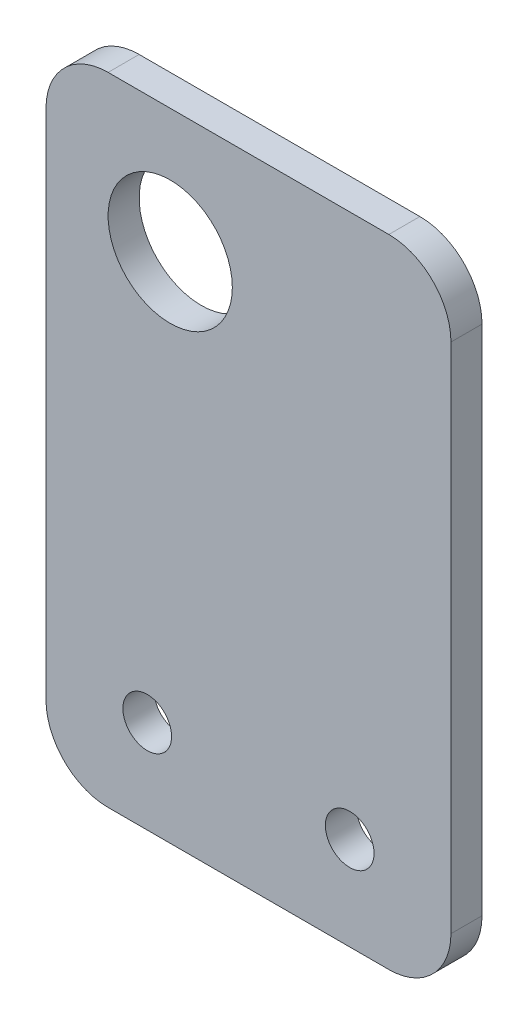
ISO-10303-21;
HEADER;
FILE_DESCRIPTION(('STEP AP214'),'2;1');
FILE_NAME('part.step','',(''),(''),'','','');
FILE_SCHEMA(('AUTOMOTIVE_DESIGN { 1 0 10303 214 1 1 1 1 }'));
ENDSEC;
DATA;
#1=APPLICATION_CONTEXT('core data for automotive mechanical design processes');
#2=APPLICATION_PROTOCOL_DEFINITION('international standard','automotive_design',2000,#1);
#3=PRODUCT_CONTEXT('',#1,'mechanical');
#4=PRODUCT('Part','Part','',(#3));
#5=PRODUCT_RELATED_PRODUCT_CATEGORY('part','',(#4));
#6=PRODUCT_DEFINITION_FORMATION('','',#4);
#7=PRODUCT_DEFINITION_CONTEXT('part definition',#1,'design');
#8=PRODUCT_DEFINITION('design','',#6,#7);
#9=PRODUCT_DEFINITION_SHAPE('','',#8);
#10=(LENGTH_UNIT() NAMED_UNIT(*) SI_UNIT(.MILLI.,.METRE.));
#11=(NAMED_UNIT(*) PLANE_ANGLE_UNIT() SI_UNIT($,.RADIAN.));
#12=(NAMED_UNIT(*) SI_UNIT($,.STERADIAN.) SOLID_ANGLE_UNIT());
#13=UNCERTAINTY_MEASURE_WITH_UNIT(LENGTH_MEASURE(1.E-05),#10,'distance_accuracy_value','');
#14=(GEOMETRIC_REPRESENTATION_CONTEXT(3) GLOBAL_UNCERTAINTY_ASSIGNED_CONTEXT((#13)) GLOBAL_UNIT_ASSIGNED_CONTEXT((#10,
#11,#12)) REPRESENTATION_CONTEXT('',''));
#15=CARTESIAN_POINT('',(0.,0.,0.));
#16=DIRECTION('',(0.,0.,1.));
#17=DIRECTION('',(1.,0.,0.));
#18=AXIS2_PLACEMENT_3D('',#15,#16,#17);
#19=CARTESIAN_POINT('',(0.,12.7,3.175));
#20=DIRECTION('',(0.,1.,0.));
#21=DIRECTION('',(0.,0.,1.));
#22=AXIS2_PLACEMENT_3D('',#19,#20,#21);
#23=PLANE('',#22);
#24=DIRECTION('',(1.,0.,0.));
#25=VECTOR('',#24,1.);
#26=CARTESIAN_POINT('',(0.,12.7,3.175));
#27=LINE('',#26,#25);
#28=CARTESIAN_POINT('',(-6.35,12.7,3.175));
#29=VERTEX_POINT('',#28);
#30=CARTESIAN_POINT('',(22.352,12.7,3.175));
#31=VERTEX_POINT('',#30);
#32=EDGE_CURVE('E164',#29,#31,#27,.T.);
#33=ORIENTED_EDGE('',*,*,#32,.T.);
#34=DIRECTION('',(0.,0.,-1.));
#35=VECTOR('',#34,1.);
#36=CARTESIAN_POINT('',(22.352,12.7,3.175));
#37=LINE('',#36,#35);
#38=CARTESIAN_POINT('',(22.352,12.7,0.));
#39=VERTEX_POINT('',#38);
#40=EDGE_CURVE('E11',#31,#39,#37,.T.);
#41=ORIENTED_EDGE('',*,*,#40,.T.);
#42=DIRECTION('',(1.,0.,0.));
#43=VECTOR('',#42,1.);
#44=CARTESIAN_POINT('',(0.,12.7,0.));
#45=LINE('',#44,#43);
#46=CARTESIAN_POINT('',(-6.35,12.7,0.));
#47=VERTEX_POINT('',#46);
#48=EDGE_CURVE('E133',#47,#39,#45,.T.);
#49=ORIENTED_EDGE('',*,*,#48,.F.);
#50=DIRECTION('',(0.,0.,-1.));
#51=VECTOR('',#50,1.);
#52=CARTESIAN_POINT('',(-6.35,12.7,3.175));
#53=LINE('',#52,#51);
#54=EDGE_CURVE('E43',#47,#29,#53,.F.);
#55=ORIENTED_EDGE('',*,*,#54,.T.);
#56=EDGE_LOOP('',(#33,#41,#49,#55));
#57=FACE_BOUND('',#56,.T.);
#58=ADVANCED_FACE('F35',(#57),#23,.T.);
#59=CARTESIAN_POINT('',(-12.7,0.,3.175));
#60=DIRECTION('',(1.,0.,0.));
#61=DIRECTION('',(0.,1.,0.));
#62=AXIS2_PLACEMENT_3D('',#59,#60,#61);
#63=PLANE('',#62);
#64=DIRECTION('',(0.,-1.,0.));
#65=VECTOR('',#64,1.);
#66=CARTESIAN_POINT('',(-12.7,0.,0.));
#67=LINE('',#66,#65);
#68=CARTESIAN_POINT('',(-12.7,6.35,0.));
#69=VERTEX_POINT('',#68);
#70=CARTESIAN_POINT('',(-12.7,-46.0375,0.));
#71=VERTEX_POINT('',#70);
#72=EDGE_CURVE('E129',#69,#71,#67,.T.);
#73=ORIENTED_EDGE('',*,*,#72,.T.);
#74=DIRECTION('',(0.,0.,-1.));
#75=VECTOR('',#74,1.);
#76=CARTESIAN_POINT('',(-12.7,-46.0375,3.175));
#77=LINE('',#76,#75);
#78=CARTESIAN_POINT('',(-12.7,-46.0375,3.175));
#79=VERTEX_POINT('',#78);
#80=EDGE_CURVE('E107',#71,#79,#77,.F.);
#81=ORIENTED_EDGE('',*,*,#80,.T.);
#82=DIRECTION('',(0.,-1.,0.));
#83=VECTOR('',#82,1.);
#84=CARTESIAN_POINT('',(-12.7,0.,3.175));
#85=LINE('',#84,#83);
#86=CARTESIAN_POINT('',(-12.7,6.35,3.175));
#87=VERTEX_POINT('',#86);
#88=EDGE_CURVE('E174',#87,#79,#85,.T.);
#89=ORIENTED_EDGE('',*,*,#88,.F.);
#90=DIRECTION('',(0.,0.,-1.));
#91=VECTOR('',#90,1.);
#92=CARTESIAN_POINT('',(-12.7,6.35,0.));
#93=LINE('',#92,#91);
#94=EDGE_CURVE('E112',#87,#69,#93,.T.);
#95=ORIENTED_EDGE('',*,*,#94,.T.);
#96=EDGE_LOOP('',(#73,#81,#89,#95));
#97=FACE_BOUND('',#96,.T.);
#98=ADVANCED_FACE('F179',(#97),#63,.F.);
#99=CARTESIAN_POINT('',(0.,-52.3875,3.175));
#100=DIRECTION('',(0.,1.,0.));
#101=DIRECTION('',(-1.,0.,0.));
#102=AXIS2_PLACEMENT_3D('',#99,#100,#101);
#103=PLANE('',#102);
#104=DIRECTION('',(1.,0.,0.));
#105=VECTOR('',#104,1.);
#106=CARTESIAN_POINT('',(0.,-52.3875,3.175));
#107=LINE('',#106,#105);
#108=CARTESIAN_POINT('',(-6.34999999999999,-52.3875,3.175));
#109=VERTEX_POINT('',#108);
#110=CARTESIAN_POINT('',(22.352,-52.3875,3.175));
#111=VERTEX_POINT('',#110);
#112=EDGE_CURVE('E121',#109,#111,#107,.T.);
#113=ORIENTED_EDGE('',*,*,#112,.F.);
#114=DIRECTION('',(0.,0.,-1.));
#115=VECTOR('',#114,1.);
#116=CARTESIAN_POINT('',(-6.34999999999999,-52.3875,3.175));
#117=LINE('',#116,#115);
#118=CARTESIAN_POINT('',(-6.34999999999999,-52.3875,0.));
#119=VERTEX_POINT('',#118);
#120=EDGE_CURVE('E106',#109,#119,#117,.T.);
#121=ORIENTED_EDGE('',*,*,#120,.T.);
#122=DIRECTION('',(1.,0.,0.));
#123=VECTOR('',#122,1.);
#124=CARTESIAN_POINT('',(0.,-52.3875,0.));
#125=LINE('',#124,#123);
#126=CARTESIAN_POINT('',(22.352,-52.3875,0.));
#127=VERTEX_POINT('',#126);
#128=EDGE_CURVE('E119',#119,#127,#125,.T.);
#129=ORIENTED_EDGE('',*,*,#128,.T.);
#130=DIRECTION('',(0.,0.,-1.));
#131=VECTOR('',#130,1.);
#132=CARTESIAN_POINT('',(22.352,-52.3875,3.175));
#133=LINE('',#132,#131);
#134=EDGE_CURVE('E123',#127,#111,#133,.F.);
#135=ORIENTED_EDGE('',*,*,#134,.T.);
#136=EDGE_LOOP('',(#113,#121,#129,#135));
#137=FACE_BOUND('',#136,.T.);
#138=ADVANCED_FACE('F118',(#137),#103,.F.);
#139=CARTESIAN_POINT('',(28.702,0.,3.175));
#140=DIRECTION('',(1.,0.,0.));
#141=DIRECTION('',(0.,1.,0.));
#142=AXIS2_PLACEMENT_3D('',#139,#140,#141);
#143=PLANE('',#142);
#144=DIRECTION('',(0.,-1.,0.));
#145=VECTOR('',#144,1.);
#146=CARTESIAN_POINT('',(28.702,0.,3.175));
#147=LINE('',#146,#145);
#148=CARTESIAN_POINT('',(28.702,6.35,3.175));
#149=VERTEX_POINT('',#148);
#150=CARTESIAN_POINT('',(28.702,-46.0375,3.175));
#151=VERTEX_POINT('',#150);
#152=EDGE_CURVE('E189',#149,#151,#147,.T.);
#153=ORIENTED_EDGE('',*,*,#152,.T.);
#154=DIRECTION('',(0.,0.,-1.));
#155=VECTOR('',#154,1.);
#156=CARTESIAN_POINT('',(28.702,-46.0375,0.));
#157=LINE('',#156,#155);
#158=CARTESIAN_POINT('',(28.702,-46.0375,0.));
#159=VERTEX_POINT('',#158);
#160=EDGE_CURVE('E157',#151,#159,#157,.T.);
#161=ORIENTED_EDGE('',*,*,#160,.T.);
#162=DIRECTION('',(0.,-1.,0.));
#163=VECTOR('',#162,1.);
#164=CARTESIAN_POINT('',(28.702,0.,0.));
#165=LINE('',#164,#163);
#166=CARTESIAN_POINT('',(28.702,6.35,0.));
#167=VERTEX_POINT('',#166);
#168=EDGE_CURVE('E128',#167,#159,#165,.T.);
#169=ORIENTED_EDGE('',*,*,#168,.F.);
#170=DIRECTION('',(0.,0.,-1.));
#171=VECTOR('',#170,1.);
#172=CARTESIAN_POINT('',(28.702,6.35,3.175));
#173=LINE('',#172,#171);
#174=EDGE_CURVE('E57',#167,#149,#173,.F.);
#175=ORIENTED_EDGE('',*,*,#174,.T.);
#176=EDGE_LOOP('',(#153,#161,#169,#175));
#177=FACE_BOUND('',#176,.T.);
#178=ADVANCED_FACE('F210',(#177),#143,.T.);
#179=CARTESIAN_POINT('',(-2.3495,-42.8625,3.175));
#180=DIRECTION('',(0.,0.,-1.));
#181=DIRECTION('',(-1.,0.,0.));
#182=AXIS2_PLACEMENT_3D('',#179,#180,#181);
#183=CYLINDRICAL_SURFACE('',#182,2.4892);
#184=CARTESIAN_POINT('',(-2.3495,-42.8625,3.175));
#185=DIRECTION('',(0.,0.,1.));
#186=DIRECTION('',(1.,0.,0.));
#187=AXIS2_PLACEMENT_3D('',#184,#185,#186);
#188=CIRCLE('',#187,2.4892);
#189=CARTESIAN_POINT('',(0.139700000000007,-42.8625,3.175));
#190=VERTEX_POINT('',#189);
#191=EDGE_CURVE('E175',#190,#190,#188,.T.);
#192=ORIENTED_EDGE('',*,*,#191,.T.);
#193=EDGE_LOOP('',(#192));
#194=FACE_BOUND('',#193,.T.);
#195=CARTESIAN_POINT('',(-2.3495,-42.8625,0.));
#196=DIRECTION('',(0.,0.,1.));
#197=DIRECTION('',(1.,0.,0.));
#198=AXIS2_PLACEMENT_3D('',#195,#196,#197);
#199=CIRCLE('',#198,2.4892);
#200=CARTESIAN_POINT('',(0.139700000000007,-42.8625,0.));
#201=VERTEX_POINT('',#200);
#202=EDGE_CURVE('E180',#201,#201,#199,.T.);
#203=ORIENTED_EDGE('',*,*,#202,.F.);
#204=EDGE_LOOP('',(#203));
#205=FACE_BOUND('',#204,.T.);
#206=ADVANCED_FACE('F207',(#194,#205),#183,.F.);
#207=CARTESIAN_POINT('',(18.3515,-42.8625,3.175));
#208=DIRECTION('',(0.,0.,-1.));
#209=DIRECTION('',(-1.,0.,0.));
#210=AXIS2_PLACEMENT_3D('',#207,#208,#209);
#211=CYLINDRICAL_SURFACE('',#210,2.4892);
#212=CARTESIAN_POINT('',(18.3515,-42.8625,3.175));
#213=DIRECTION('',(0.,0.,1.));
#214=DIRECTION('',(1.,0.,0.));
#215=AXIS2_PLACEMENT_3D('',#212,#213,#214);
#216=CIRCLE('',#215,2.4892);
#217=CARTESIAN_POINT('',(20.8407,-42.8625,3.175));
#218=VERTEX_POINT('',#217);
#219=EDGE_CURVE('E139',#218,#218,#216,.T.);
#220=ORIENTED_EDGE('',*,*,#219,.T.);
#221=EDGE_LOOP('',(#220));
#222=FACE_BOUND('',#221,.T.);
#223=CARTESIAN_POINT('',(18.3515,-42.8625,0.));
#224=DIRECTION('',(0.,0.,1.));
#225=DIRECTION('',(1.,0.,0.));
#226=AXIS2_PLACEMENT_3D('',#223,#224,#225);
#227=CIRCLE('',#226,2.4892);
#228=CARTESIAN_POINT('',(20.8407,-42.8625,0.));
#229=VERTEX_POINT('',#228);
#230=EDGE_CURVE('E182',#229,#229,#227,.T.);
#231=ORIENTED_EDGE('',*,*,#230,.F.);
#232=EDGE_LOOP('',(#231));
#233=FACE_BOUND('',#232,.T.);
#234=ADVANCED_FACE('F198',(#222,#233),#211,.F.);
#235=CARTESIAN_POINT('',(0.,0.,3.175));
#236=DIRECTION('',(0.,0.,-1.));
#237=DIRECTION('',(-1.,0.,0.));
#238=AXIS2_PLACEMENT_3D('',#235,#236,#237);
#239=CYLINDRICAL_SURFACE('',#238,6.35);
#240=CARTESIAN_POINT('',(0.,0.,3.175));
#241=DIRECTION('',(0.,0.,1.));
#242=DIRECTION('',(1.,0.,0.));
#243=AXIS2_PLACEMENT_3D('',#240,#241,#242);
#244=CIRCLE('',#243,6.35);
#245=CARTESIAN_POINT('',(6.35,0.,3.175));
#246=VERTEX_POINT('',#245);
#247=EDGE_CURVE('E140',#246,#246,#244,.T.);
#248=ORIENTED_EDGE('',*,*,#247,.T.);
#249=EDGE_LOOP('',(#248));
#250=FACE_BOUND('',#249,.T.);
#251=CARTESIAN_POINT('',(0.,0.,0.));
#252=DIRECTION('',(0.,0.,1.));
#253=DIRECTION('',(1.,0.,0.));
#254=AXIS2_PLACEMENT_3D('',#251,#252,#253);
#255=CIRCLE('',#254,6.35);
#256=CARTESIAN_POINT('',(6.35,0.,0.));
#257=VERTEX_POINT('',#256);
#258=EDGE_CURVE('E131',#257,#257,#255,.T.);
#259=ORIENTED_EDGE('',*,*,#258,.F.);
#260=EDGE_LOOP('',(#259));
#261=FACE_BOUND('',#260,.T.);
#262=ADVANCED_FACE('F203',(#250,#261),#239,.F.);
#263=CARTESIAN_POINT('',(0.,0.,3.175));
#264=DIRECTION('',(0.,0.,1.));
#265=DIRECTION('',(1.,0.,0.));
#266=AXIS2_PLACEMENT_3D('',#263,#264,#265);
#267=PLANE('',#266);
#268=ORIENTED_EDGE('',*,*,#219,.F.);
#269=EDGE_LOOP('',(#268));
#270=FACE_BOUND('',#269,.T.);
#271=ORIENTED_EDGE('',*,*,#191,.F.);
#272=EDGE_LOOP('',(#271));
#273=FACE_BOUND('',#272,.T.);
#274=ORIENTED_EDGE('',*,*,#88,.T.);
#275=CARTESIAN_POINT('',(-6.35,-46.0375,3.175));
#276=DIRECTION('',(0.,0.,1.));
#277=DIRECTION('',(1.,0.,0.));
#278=AXIS2_PLACEMENT_3D('',#275,#276,#277);
#279=CIRCLE('',#278,6.35);
#280=EDGE_CURVE('E154',#79,#109,#279,.T.);
#281=ORIENTED_EDGE('',*,*,#280,.T.);
#282=ORIENTED_EDGE('',*,*,#112,.T.);
#283=CARTESIAN_POINT('',(22.352,-46.0375,3.175));
#284=DIRECTION('',(0.,0.,1.));
#285=DIRECTION('',(1.,0.,0.));
#286=AXIS2_PLACEMENT_3D('',#283,#284,#285);
#287=CIRCLE('',#286,6.35);
#288=EDGE_CURVE('E50',#111,#151,#287,.T.);
#289=ORIENTED_EDGE('',*,*,#288,.T.);
#290=ORIENTED_EDGE('',*,*,#152,.F.);
#291=CARTESIAN_POINT('',(22.352,6.35,3.175));
#292=DIRECTION('',(0.,0.,1.));
#293=DIRECTION('',(1.,0.,0.));
#294=AXIS2_PLACEMENT_3D('',#291,#292,#293);
#295=CIRCLE('',#294,6.35);
#296=EDGE_CURVE('E151',#149,#31,#295,.T.);
#297=ORIENTED_EDGE('',*,*,#296,.T.);
#298=ORIENTED_EDGE('',*,*,#32,.F.);
#299=CARTESIAN_POINT('',(-6.35,6.35,3.175));
#300=DIRECTION('',(0.,0.,1.));
#301=DIRECTION('',(1.,0.,0.));
#302=AXIS2_PLACEMENT_3D('',#299,#300,#301);
#303=CIRCLE('',#302,6.35);
#304=EDGE_CURVE('E149',#29,#87,#303,.T.);
#305=ORIENTED_EDGE('',*,*,#304,.T.);
#306=EDGE_LOOP('',(#274,#281,#282,#289,#290,#297,#298,#305));
#307=FACE_BOUND('',#306,.T.);
#308=ORIENTED_EDGE('',*,*,#247,.F.);
#309=EDGE_LOOP('',(#308));
#310=FACE_BOUND('',#309,.T.);
#311=ADVANCED_FACE('F170',(#270,#273,#307,#310),#267,.T.);
#312=CARTESIAN_POINT('',(0.,0.,0.));
#313=DIRECTION('',(0.,0.,1.));
#314=DIRECTION('',(1.,0.,0.));
#315=AXIS2_PLACEMENT_3D('',#312,#313,#314);
#316=PLANE('',#315);
#317=ORIENTED_EDGE('',*,*,#230,.T.);
#318=EDGE_LOOP('',(#317));
#319=FACE_BOUND('',#318,.T.);
#320=ORIENTED_EDGE('',*,*,#202,.T.);
#321=EDGE_LOOP('',(#320));
#322=FACE_BOUND('',#321,.T.);
#323=ORIENTED_EDGE('',*,*,#128,.F.);
#324=CARTESIAN_POINT('',(-6.35,-46.0375,0.));
#325=DIRECTION('',(0.,0.,1.));
#326=DIRECTION('',(1.,0.,0.));
#327=AXIS2_PLACEMENT_3D('',#324,#325,#326);
#328=CIRCLE('',#327,6.35);
#329=EDGE_CURVE('E102',#119,#71,#328,.F.);
#330=ORIENTED_EDGE('',*,*,#329,.T.);
#331=ORIENTED_EDGE('',*,*,#72,.F.);
#332=CARTESIAN_POINT('',(-6.35,6.35,0.));
#333=DIRECTION('',(0.,0.,1.));
#334=DIRECTION('',(1.,0.,0.));
#335=AXIS2_PLACEMENT_3D('',#332,#333,#334);
#336=CIRCLE('',#335,6.35);
#337=EDGE_CURVE('E122',#69,#47,#336,.F.);
#338=ORIENTED_EDGE('',*,*,#337,.T.);
#339=ORIENTED_EDGE('',*,*,#48,.T.);
#340=CARTESIAN_POINT('',(22.352,6.35,0.));
#341=DIRECTION('',(0.,0.,1.));
#342=DIRECTION('',(1.,0.,0.));
#343=AXIS2_PLACEMENT_3D('',#340,#341,#342);
#344=CIRCLE('',#343,6.35);
#345=EDGE_CURVE('E143',#39,#167,#344,.F.);
#346=ORIENTED_EDGE('',*,*,#345,.T.);
#347=ORIENTED_EDGE('',*,*,#168,.T.);
#348=CARTESIAN_POINT('',(22.352,-46.0375,0.));
#349=DIRECTION('',(0.,0.,1.));
#350=DIRECTION('',(1.,0.,0.));
#351=AXIS2_PLACEMENT_3D('',#348,#349,#350);
#352=CIRCLE('',#351,6.35);
#353=EDGE_CURVE('E113',#159,#127,#352,.F.);
#354=ORIENTED_EDGE('',*,*,#353,.T.);
#355=EDGE_LOOP('',(#323,#330,#331,#338,#339,#346,#347,#354));
#356=FACE_BOUND('',#355,.T.);
#357=ORIENTED_EDGE('',*,*,#258,.T.);
#358=EDGE_LOOP('',(#357));
#359=FACE_BOUND('',#358,.T.);
#360=ADVANCED_FACE('F125',(#319,#322,#356,#359),#316,.F.);
#361=CARTESIAN_POINT('',(-6.35,-46.0375,3.175));
#362=DIRECTION('',(0.,0.,-1.));
#363=DIRECTION('',(-1.,0.,0.));
#364=AXIS2_PLACEMENT_3D('',#361,#362,#363);
#365=CYLINDRICAL_SURFACE('',#364,6.35);
#366=ORIENTED_EDGE('',*,*,#280,.F.);
#367=ORIENTED_EDGE('',*,*,#80,.F.);
#368=ORIENTED_EDGE('',*,*,#329,.F.);
#369=ORIENTED_EDGE('',*,*,#120,.F.);
#370=EDGE_LOOP('',(#366,#367,#368,#369));
#371=FACE_BOUND('',#370,.T.);
#372=ADVANCED_FACE('F105',(#371),#365,.T.);
#373=CARTESIAN_POINT('',(22.352,-46.0375,3.175));
#374=DIRECTION('',(0.,0.,1.));
#375=DIRECTION('',(1.,0.,0.));
#376=AXIS2_PLACEMENT_3D('',#373,#374,#375);
#377=CYLINDRICAL_SURFACE('',#376,6.35);
#378=ORIENTED_EDGE('',*,*,#288,.F.);
#379=ORIENTED_EDGE('',*,*,#134,.F.);
#380=ORIENTED_EDGE('',*,*,#353,.F.);
#381=ORIENTED_EDGE('',*,*,#160,.F.);
#382=EDGE_LOOP('',(#378,#379,#380,#381));
#383=FACE_BOUND('',#382,.T.);
#384=ADVANCED_FACE('F220',(#383),#377,.T.);
#385=CARTESIAN_POINT('',(22.352,6.35,3.175));
#386=DIRECTION('',(0.,0.,-1.));
#387=DIRECTION('',(-1.,0.,0.));
#388=AXIS2_PLACEMENT_3D('',#385,#386,#387);
#389=CYLINDRICAL_SURFACE('',#388,6.35);
#390=ORIENTED_EDGE('',*,*,#296,.F.);
#391=ORIENTED_EDGE('',*,*,#174,.F.);
#392=ORIENTED_EDGE('',*,*,#345,.F.);
#393=ORIENTED_EDGE('',*,*,#40,.F.);
#394=EDGE_LOOP('',(#390,#391,#392,#393));
#395=FACE_BOUND('',#394,.T.);
#396=ADVANCED_FACE('F234',(#395),#389,.T.);
#397=CARTESIAN_POINT('',(-6.35,6.35,3.175));
#398=DIRECTION('',(0.,0.,1.));
#399=DIRECTION('',(1.,0.,0.));
#400=AXIS2_PLACEMENT_3D('',#397,#398,#399);
#401=CYLINDRICAL_SURFACE('',#400,6.35);
#402=ORIENTED_EDGE('',*,*,#304,.F.);
#403=ORIENTED_EDGE('',*,*,#54,.F.);
#404=ORIENTED_EDGE('',*,*,#337,.F.);
#405=ORIENTED_EDGE('',*,*,#94,.F.);
#406=EDGE_LOOP('',(#402,#403,#404,#405));
#407=FACE_BOUND('',#406,.T.);
#408=ADVANCED_FACE('F37',(#407),#401,.T.);
#409=CLOSED_SHELL('',(#58,#98,#138,#178,#206,#234,#262,#311,#360,#372,#384,#396,#408));
#410=MANIFOLD_SOLID_BREP('B2',#409);
#411=ADVANCED_BREP_SHAPE_REPRESENTATION('',(#18,#410),#14);
#412=SHAPE_DEFINITION_REPRESENTATION(#9,#411);
ENDSEC;
END-ISO-10303-21;
